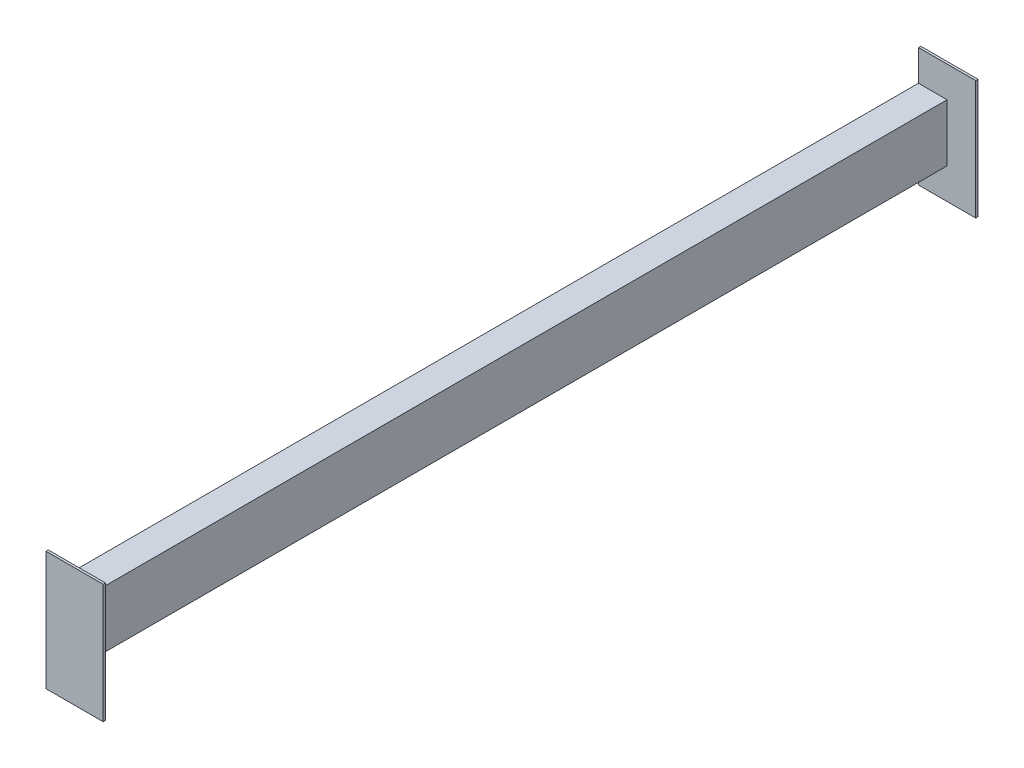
from build123d import *

# Parameters (mm, degrees)
ESQUISSE1_W      = 25
ESQUISSE1_H      = 50
ESQUISSE1_W_2    = 21
ESQUISSE1_H_2    = 46
EXTRUSION1_DEPTH = 760
ESQUISSE2_W      = 50
ESQUISSE2_H      = 104
EXTRUSION2_DEPTH = 2
ESQUISSE5_W      = 50
ESQUISSE5_H      = 104
EXTRUSION3_DEPTH = 2


with BuildPart() as part:
    # Esquisse1 → Extrusion1 (new body)
    with BuildSketch(Plane.XY):
        with Locations((12.5, 25)):
            Rectangle(ESQUISSE1_W, ESQUISSE1_H)
        with Locations((12.5, 25)):
            Rectangle(ESQUISSE1_W_2, ESQUISSE1_H_2, mode=Mode.SUBTRACT)
    extrude(amount=EXTRUSION1_DEPTH)

    # Esquisse2 → Extrusion2 (add)
    with BuildSketch(Plane.XY.offset(760)):
        with Locations((25, 25)):
            Rectangle(ESQUISSE2_W, ESQUISSE2_H)
    extrude(amount=EXTRUSION2_DEPTH)

    # Esquisse5 → Extrusion3 (add)
    with BuildSketch(Plane(origin=(0, 0, 0), x_dir=(-1, 0, 0), z_dir=(0, 0, -1))):
        with Locations((-25, 25)):
            Rectangle(ESQUISSE5_W, ESQUISSE5_H)
    extrude(amount=EXTRUSION3_DEPTH)


solid = part.part
